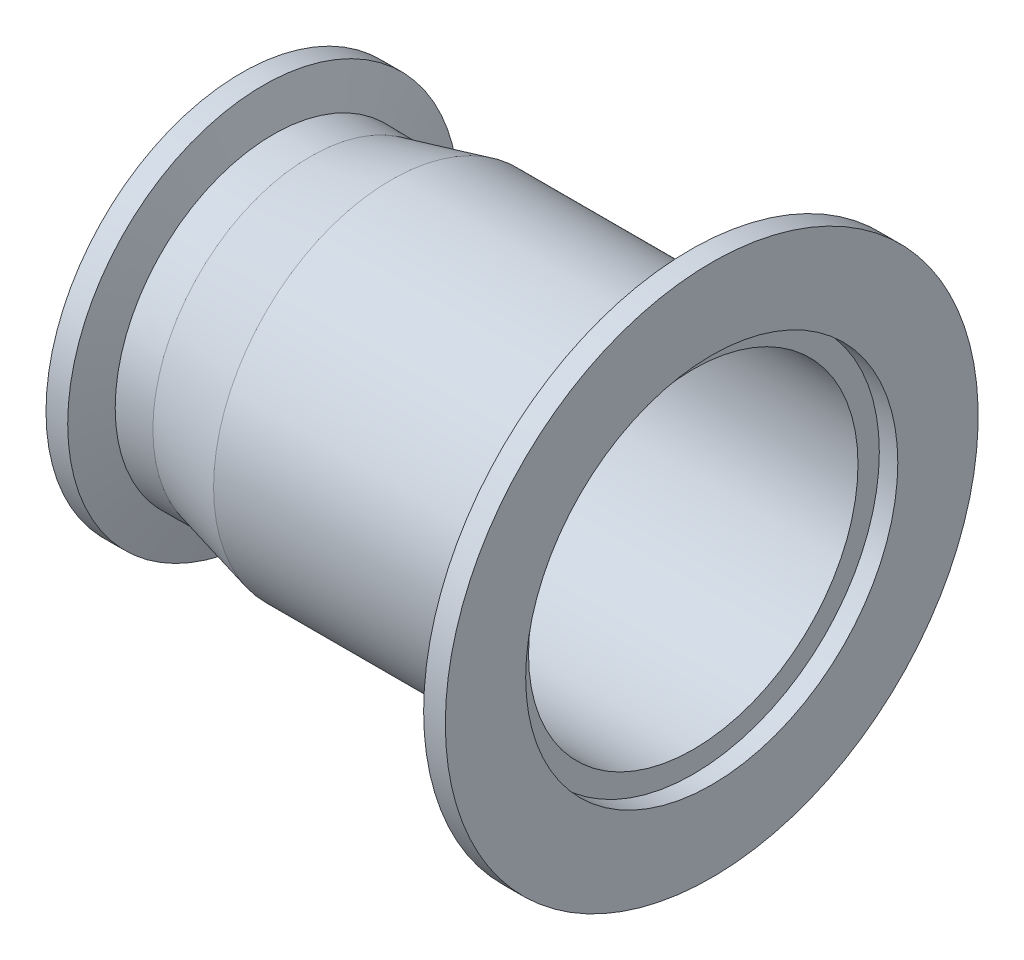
from build123d import *


with BuildPart() as part:
    # Sketch1 → Revolve3 (revolve)
    with BuildSketch(Plane(origin=(0, 0, 0), x_dir=(1, 0, 0), z_dir=(0, 1, 0)), mode=Mode.PRIVATE) as revolve3_sk:
        Polygon((66.585109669, 11.466989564), (66.585109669, 8.466989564), (28.146000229, 8.466989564), (5.662391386, 2.896989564), (5.662391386, 5.896989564), (3.062391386, 5.896989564), (3.062391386, 12.796989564), (6.112391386, 12.796989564), (7.522391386, 7.526989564), (12.762391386, 7.466989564), (24.105109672, 10.276989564), (64.105109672, 10.276989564), (64.105109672, 15.186989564), (66.135109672, 22.766989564), (69.185109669, 22.766989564), (69.185109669, 11.466989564), align=None)
    revolve(revolve3_sk.sketch.rotate(Axis((0, 0, 14.69801), (1, 0, 0)), 180), axis=Axis((0, 0, 14.69801), (1, 0, 0)))


solid = part.part
